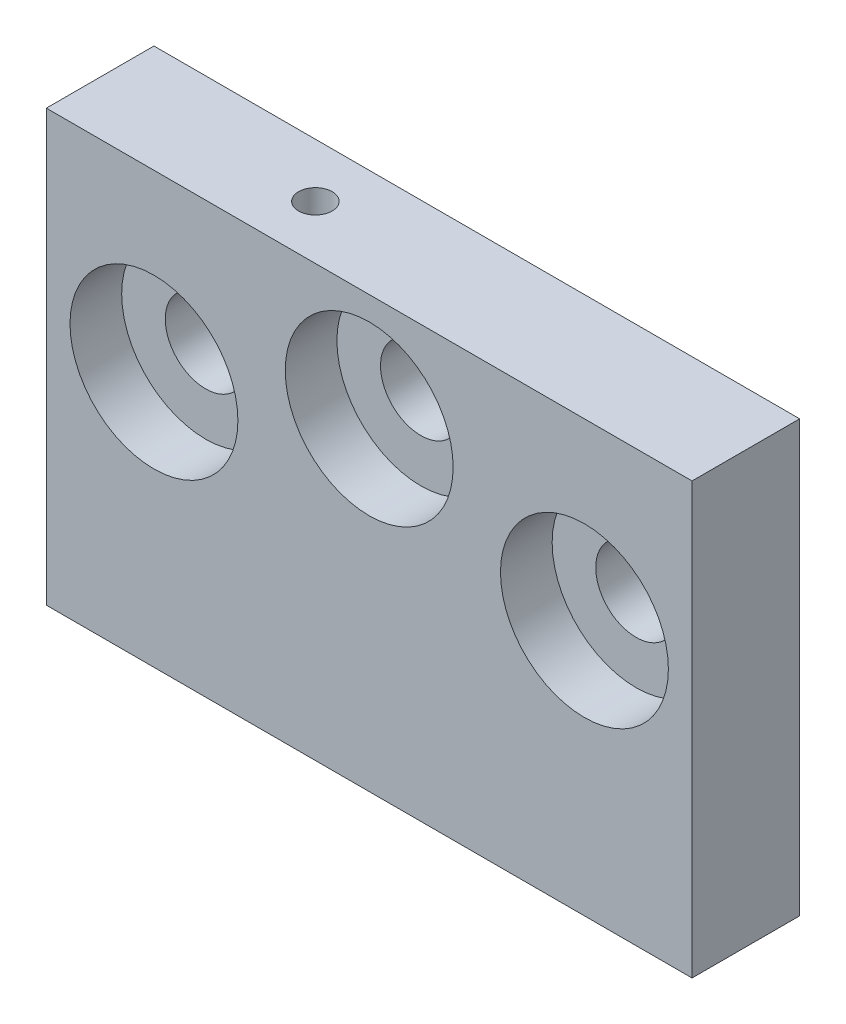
from build123d import *

# Parameters (mm, degrees)
SKETCH2_W           = 76.2
SKETCH2_H           = 50.8
SKETCH2_R           = 4.7625
BOSS_EXTRUDE1_DEPTH = 12.7
SKETCH3_R           = 9.906
CUT_EXTRUDE1_DEPTH  = 6.096
SKETCH5_R           = 1.9812
CUT_EXTRUDE2_DEPTH  = 76.2
SKETCH6_R           = 2.9718
CUT_EXTRUDE3_DEPTH  = 15.875


with BuildPart() as part:
    # Sketch2 → Boss-Extrude1 (new body)
    with BuildSketch(Plane.XY):
        Rectangle(SKETCH2_W, SKETCH2_H)
        with Locations((-25.4, 4.7752)):
            Circle(SKETCH2_R, mode=Mode.SUBTRACT)
        with Locations((0, 12.7)):
            Circle(SKETCH2_R, mode=Mode.SUBTRACT)
        with Locations((25.4, 4.7752)):
            Circle(SKETCH2_R, mode=Mode.SUBTRACT)
    extrude(amount=-BOSS_EXTRUDE1_DEPTH)

    # Sketch3 → Cut-Extrude1 (cut)
    with BuildSketch(Plane.XY):
        with Locations((-25.4, 4.7752)):
            Circle(SKETCH3_R)
        with Locations((0, 12.7)):
            Circle(SKETCH3_R)
        with Locations((25.4, 4.7752)):
            Circle(SKETCH3_R)
    extrude(amount=-CUT_EXTRUDE1_DEPTH, mode=Mode.SUBTRACT)

    # Sketch5 → Cut-Extrude2 (cut)
    with BuildSketch(Plane.XZ.offset(25.4)):
        with Locations((-12.7, -6.35)):
            Circle(SKETCH5_R)
    extrude(amount=-CUT_EXTRUDE2_DEPTH, mode=Mode.SUBTRACT)

    # Sketch6 → Cut-Extrude3 (cut)
    with BuildSketch(Plane.XZ.offset(25.4)):
        with Locations((-12.7, -6.35)):
            Circle(SKETCH6_R)
    extrude(amount=-CUT_EXTRUDE3_DEPTH, mode=Mode.SUBTRACT)


solid = part.part
